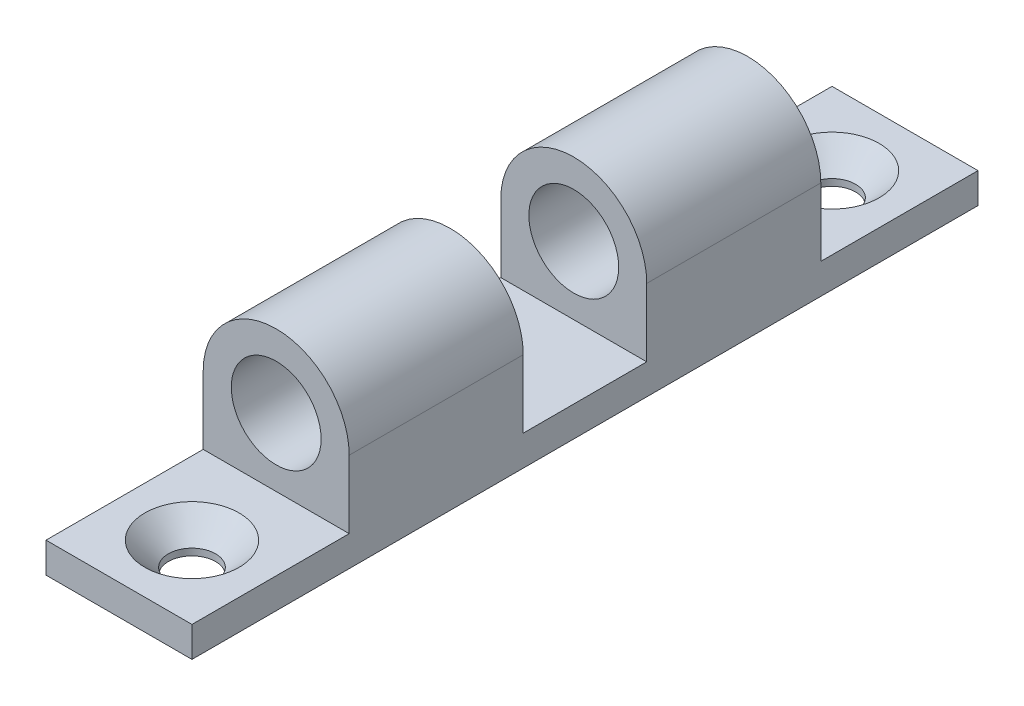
ISO-10303-21;
HEADER;
FILE_DESCRIPTION(('STEP AP214'),'2;1');
FILE_NAME('part.step','',(''),(''),'','','');
FILE_SCHEMA(('AUTOMOTIVE_DESIGN { 1 0 10303 214 1 1 1 1 }'));
ENDSEC;
DATA;
#1=APPLICATION_CONTEXT('core data for automotive mechanical design processes');
#2=APPLICATION_PROTOCOL_DEFINITION('international standard','automotive_design',2000,#1);
#3=PRODUCT_CONTEXT('',#1,'mechanical');
#4=PRODUCT('Part','Part','',(#3));
#5=PRODUCT_RELATED_PRODUCT_CATEGORY('part','',(#4));
#6=PRODUCT_DEFINITION_FORMATION('','',#4);
#7=PRODUCT_DEFINITION_CONTEXT('part definition',#1,'design');
#8=PRODUCT_DEFINITION('design','',#6,#7);
#9=PRODUCT_DEFINITION_SHAPE('','',#8);
#10=(LENGTH_UNIT() NAMED_UNIT(*) SI_UNIT(.MILLI.,.METRE.));
#11=(NAMED_UNIT(*) PLANE_ANGLE_UNIT() SI_UNIT($,.RADIAN.));
#12=(NAMED_UNIT(*) SI_UNIT($,.STERADIAN.) SOLID_ANGLE_UNIT());
#13=UNCERTAINTY_MEASURE_WITH_UNIT(LENGTH_MEASURE(1.E-05),#10,'distance_accuracy_value','');
#14=(GEOMETRIC_REPRESENTATION_CONTEXT(3) GLOBAL_UNCERTAINTY_ASSIGNED_CONTEXT((#13)) GLOBAL_UNIT_ASSIGNED_CONTEXT((#10,
#11,#12)) REPRESENTATION_CONTEXT('',''));
#15=CARTESIAN_POINT('',(0.,0.,0.));
#16=DIRECTION('',(0.,0.,1.));
#17=DIRECTION('',(1.,0.,0.));
#18=AXIS2_PLACEMENT_3D('',#15,#16,#17);
#19=CARTESIAN_POINT('',(0.,8.75,0.));
#20=DIRECTION('',(0.,0.,1.));
#21=DIRECTION('',(1.,0.,0.));
#22=AXIS2_PLACEMENT_3D('',#19,#20,#21);
#23=CYLINDRICAL_SURFACE('',#22,4.);
#24=CARTESIAN_POINT('',(0.,8.75,-5.5));
#25=DIRECTION('',(0.,0.,1.));
#26=DIRECTION('',(1.,0.,0.));
#27=AXIS2_PLACEMENT_3D('',#24,#25,#26);
#28=CIRCLE('',#27,4.);
#29=CARTESIAN_POINT('',(4.,8.75,-5.5));
#30=VERTEX_POINT('',#29);
#31=EDGE_CURVE('E199',#30,#30,#28,.T.);
#32=ORIENTED_EDGE('',*,*,#31,.T.);
#33=EDGE_LOOP('',(#32));
#34=FACE_BOUND('',#33,.T.);
#35=CARTESIAN_POINT('',(0.,8.75,-21.));
#36=DIRECTION('',(0.,0.,1.));
#37=DIRECTION('',(1.,0.,0.));
#38=AXIS2_PLACEMENT_3D('',#35,#36,#37);
#39=CIRCLE('',#38,4.);
#40=CARTESIAN_POINT('',(4.,8.75,-21.));
#41=VERTEX_POINT('',#40);
#42=EDGE_CURVE('E20',#41,#41,#39,.F.);
#43=ORIENTED_EDGE('',*,*,#42,.T.);
#44=EDGE_LOOP('',(#43));
#45=FACE_BOUND('',#44,.T.);
#46=ADVANCED_FACE('F16',(#34,#45),#23,.F.);
#47=CARTESIAN_POINT('',(0.,8.75,0.));
#48=DIRECTION('',(0.,0.,1.));
#49=DIRECTION('',(1.,0.,0.));
#50=AXIS2_PLACEMENT_3D('',#47,#48,#49);
#51=CYLINDRICAL_SURFACE('',#50,4.);
#52=CARTESIAN_POINT('',(0.,8.75,21.));
#53=DIRECTION('',(0.,0.,1.));
#54=DIRECTION('',(1.,0.,0.));
#55=AXIS2_PLACEMENT_3D('',#52,#53,#54);
#56=CIRCLE('',#55,4.);
#57=CARTESIAN_POINT('',(4.,8.75,21.));
#58=VERTEX_POINT('',#57);
#59=EDGE_CURVE('E188',#58,#58,#56,.T.);
#60=ORIENTED_EDGE('',*,*,#59,.T.);
#61=EDGE_LOOP('',(#60));
#62=FACE_BOUND('',#61,.T.);
#63=CARTESIAN_POINT('',(0.,8.75,5.5));
#64=DIRECTION('',(0.,0.,1.));
#65=DIRECTION('',(1.,0.,0.));
#66=AXIS2_PLACEMENT_3D('',#63,#64,#65);
#67=CIRCLE('',#66,4.);
#68=CARTESIAN_POINT('',(4.,8.75,5.5));
#69=VERTEX_POINT('',#68);
#70=EDGE_CURVE('E195',#69,#69,#67,.F.);
#71=ORIENTED_EDGE('',*,*,#70,.T.);
#72=EDGE_LOOP('',(#71));
#73=FACE_BOUND('',#72,.T.);
#74=ADVANCED_FACE('F303',(#62,#73),#51,.F.);
#75=CARTESIAN_POINT('',(6.5,2.7,-21.));
#76=DIRECTION('',(0.,0.,1.));
#77=DIRECTION('',(1.,0.,0.));
#78=AXIS2_PLACEMENT_3D('',#75,#76,#77);
#79=PLANE('',#78);
#80=ORIENTED_EDGE('',*,*,#42,.F.);
#81=EDGE_LOOP('',(#80));
#82=FACE_BOUND('',#81,.T.);
#83=DIRECTION('',(0.,1.,0.));
#84=VECTOR('',#83,1.);
#85=CARTESIAN_POINT('',(6.5,8.75,-21.));
#86=LINE('',#85,#84);
#87=CARTESIAN_POINT('',(6.5,2.7,-21.));
#88=VERTEX_POINT('',#87);
#89=CARTESIAN_POINT('',(6.5,8.75,-21.));
#90=VERTEX_POINT('',#89);
#91=EDGE_CURVE('E107',#88,#90,#86,.T.);
#92=ORIENTED_EDGE('',*,*,#91,.F.);
#93=DIRECTION('',(1.,0.,0.));
#94=VECTOR('',#93,1.);
#95=CARTESIAN_POINT('',(0.,2.7,-21.));
#96=LINE('',#95,#94);
#97=CARTESIAN_POINT('',(-6.5,2.7,-21.));
#98=VERTEX_POINT('',#97);
#99=EDGE_CURVE('E134',#98,#88,#96,.T.);
#100=ORIENTED_EDGE('',*,*,#99,.F.);
#101=DIRECTION('',(0.,1.,0.));
#102=VECTOR('',#101,1.);
#103=CARTESIAN_POINT('',(-6.5,0.,-21.));
#104=LINE('',#103,#102);
#105=CARTESIAN_POINT('',(-6.5,8.75,-21.));
#106=VERTEX_POINT('',#105);
#107=EDGE_CURVE('E110',#106,#98,#104,.F.);
#108=ORIENTED_EDGE('',*,*,#107,.F.);
#109=CARTESIAN_POINT('',(0.,8.75,-21.));
#110=DIRECTION('',(0.,0.,1.));
#111=DIRECTION('',(1.,0.,0.));
#112=AXIS2_PLACEMENT_3D('',#109,#110,#111);
#113=CIRCLE('',#112,6.5);
#114=EDGE_CURVE('E103',#90,#106,#113,.T.);
#115=ORIENTED_EDGE('',*,*,#114,.F.);
#116=EDGE_LOOP('',(#92,#100,#108,#115));
#117=FACE_BOUND('',#116,.T.);
#118=ADVANCED_FACE('F105',(#82,#117),#79,.F.);
#119=CARTESIAN_POINT('',(0.,8.75,0.));
#120=DIRECTION('',(0.,0.,1.));
#121=DIRECTION('',(1.,0.,0.));
#122=AXIS2_PLACEMENT_3D('',#119,#120,#121);
#123=CYLINDRICAL_SURFACE('',#122,6.5);
#124=CARTESIAN_POINT('',(0.,8.75,-5.5));
#125=DIRECTION('',(0.,0.,1.));
#126=DIRECTION('',(1.,0.,0.));
#127=AXIS2_PLACEMENT_3D('',#124,#125,#126);
#128=CIRCLE('',#127,6.5);
#129=CARTESIAN_POINT('',(-6.5,8.75,-5.5));
#130=VERTEX_POINT('',#129);
#131=CARTESIAN_POINT('',(6.5,8.75,-5.5));
#132=VERTEX_POINT('',#131);
#133=EDGE_CURVE('E114',#130,#132,#128,.F.);
#134=ORIENTED_EDGE('',*,*,#133,.T.);
#135=DIRECTION('',(0.,0.,-1.));
#136=VECTOR('',#135,1.);
#137=CARTESIAN_POINT('',(6.5,8.75,0.));
#138=LINE('',#137,#136);
#139=EDGE_CURVE('E116',#90,#132,#138,.F.);
#140=ORIENTED_EDGE('',*,*,#139,.F.);
#141=ORIENTED_EDGE('',*,*,#114,.T.);
#142=DIRECTION('',(0.,0.,1.));
#143=VECTOR('',#142,1.);
#144=CARTESIAN_POINT('',(-6.5,8.75,0.));
#145=LINE('',#144,#143);
#146=EDGE_CURVE('E140',#130,#106,#145,.F.);
#147=ORIENTED_EDGE('',*,*,#146,.F.);
#148=EDGE_LOOP('',(#134,#140,#141,#147));
#149=FACE_BOUND('',#148,.T.);
#150=ADVANCED_FACE('F117',(#149),#123,.T.);
#151=CARTESIAN_POINT('',(-6.5,2.7,-5.5));
#152=DIRECTION('',(0.,0.,-1.));
#153=DIRECTION('',(-1.,0.,0.));
#154=AXIS2_PLACEMENT_3D('',#151,#152,#153);
#155=PLANE('',#154);
#156=ORIENTED_EDGE('',*,*,#31,.F.);
#157=EDGE_LOOP('',(#156));
#158=FACE_BOUND('',#157,.T.);
#159=DIRECTION('',(0.,1.,0.));
#160=VECTOR('',#159,1.);
#161=CARTESIAN_POINT('',(-6.5,0.,-5.5));
#162=LINE('',#161,#160);
#163=CARTESIAN_POINT('',(-6.5,2.7,-5.5));
#164=VERTEX_POINT('',#163);
#165=EDGE_CURVE('E142',#164,#130,#162,.T.);
#166=ORIENTED_EDGE('',*,*,#165,.F.);
#167=DIRECTION('',(1.,0.,0.));
#168=VECTOR('',#167,1.);
#169=CARTESIAN_POINT('',(0.,2.7,-5.5));
#170=LINE('',#169,#168);
#171=CARTESIAN_POINT('',(6.5,2.7,-5.5));
#172=VERTEX_POINT('',#171);
#173=EDGE_CURVE('E202',#172,#164,#170,.F.);
#174=ORIENTED_EDGE('',*,*,#173,.F.);
#175=DIRECTION('',(0.,1.,0.));
#176=VECTOR('',#175,1.);
#177=CARTESIAN_POINT('',(6.5,8.75,-5.5));
#178=LINE('',#177,#176);
#179=EDGE_CURVE('E121',#132,#172,#178,.F.);
#180=ORIENTED_EDGE('',*,*,#179,.F.);
#181=ORIENTED_EDGE('',*,*,#133,.F.);
#182=EDGE_LOOP('',(#166,#174,#180,#181));
#183=FACE_BOUND('',#182,.T.);
#184=ADVANCED_FACE('F312',(#158,#183),#155,.F.);
#185=CARTESIAN_POINT('',(0.,2.7,0.));
#186=DIRECTION('',(0.,1.,0.));
#187=DIRECTION('',(0.,0.,1.));
#188=AXIS2_PLACEMENT_3D('',#185,#186,#187);
#189=PLANE('',#188);
#190=DIRECTION('',(0.,0.,-1.));
#191=VECTOR('',#190,1.);
#192=CARTESIAN_POINT('',(6.5,2.7,0.));
#193=LINE('',#192,#191);
#194=CARTESIAN_POINT('',(6.5,2.7,5.5));
#195=VERTEX_POINT('',#194);
#196=EDGE_CURVE('E212',#172,#195,#193,.F.);
#197=ORIENTED_EDGE('',*,*,#196,.F.);
#198=ORIENTED_EDGE('',*,*,#173,.T.);
#199=DIRECTION('',(0.,0.,1.));
#200=VECTOR('',#199,1.);
#201=CARTESIAN_POINT('',(-6.5,2.7,0.));
#202=LINE('',#201,#200);
#203=CARTESIAN_POINT('',(-6.5,2.7,5.5));
#204=VERTEX_POINT('',#203);
#205=EDGE_CURVE('E145',#204,#164,#202,.F.);
#206=ORIENTED_EDGE('',*,*,#205,.F.);
#207=DIRECTION('',(1.,0.,0.));
#208=VECTOR('',#207,1.);
#209=CARTESIAN_POINT('',(6.5,2.7,5.5));
#210=LINE('',#209,#208);
#211=EDGE_CURVE('E198',#204,#195,#210,.T.);
#212=ORIENTED_EDGE('',*,*,#211,.T.);
#213=EDGE_LOOP('',(#197,#198,#206,#212));
#214=FACE_BOUND('',#213,.T.);
#215=ADVANCED_FACE('F315',(#214),#189,.T.);
#216=CARTESIAN_POINT('',(6.5,2.7,5.5));
#217=DIRECTION('',(0.,0.,1.));
#218=DIRECTION('',(1.,0.,0.));
#219=AXIS2_PLACEMENT_3D('',#216,#217,#218);
#220=PLANE('',#219);
#221=ORIENTED_EDGE('',*,*,#70,.F.);
#222=EDGE_LOOP('',(#221));
#223=FACE_BOUND('',#222,.T.);
#224=DIRECTION('',(0.,1.,0.));
#225=VECTOR('',#224,1.);
#226=CARTESIAN_POINT('',(6.5,8.75,5.5));
#227=LINE('',#226,#225);
#228=CARTESIAN_POINT('',(6.5,8.75,5.5));
#229=VERTEX_POINT('',#228);
#230=EDGE_CURVE('E214',#195,#229,#227,.T.);
#231=ORIENTED_EDGE('',*,*,#230,.F.);
#232=ORIENTED_EDGE('',*,*,#211,.F.);
#233=DIRECTION('',(0.,1.,0.));
#234=VECTOR('',#233,1.);
#235=CARTESIAN_POINT('',(-6.5,0.,5.5));
#236=LINE('',#235,#234);
#237=CARTESIAN_POINT('',(-6.5,8.75,5.5));
#238=VERTEX_POINT('',#237);
#239=EDGE_CURVE('E148',#238,#204,#236,.F.);
#240=ORIENTED_EDGE('',*,*,#239,.F.);
#241=CARTESIAN_POINT('',(0.,8.75,5.5));
#242=DIRECTION('',(0.,0.,1.));
#243=DIRECTION('',(1.,0.,0.));
#244=AXIS2_PLACEMENT_3D('',#241,#242,#243);
#245=CIRCLE('',#244,6.5);
#246=EDGE_CURVE('E193',#229,#238,#245,.T.);
#247=ORIENTED_EDGE('',*,*,#246,.F.);
#248=EDGE_LOOP('',(#231,#232,#240,#247));
#249=FACE_BOUND('',#248,.T.);
#250=ADVANCED_FACE('F319',(#223,#249),#220,.F.);
#251=CARTESIAN_POINT('',(0.,8.75,0.));
#252=DIRECTION('',(0.,0.,1.));
#253=DIRECTION('',(1.,0.,0.));
#254=AXIS2_PLACEMENT_3D('',#251,#252,#253);
#255=CYLINDRICAL_SURFACE('',#254,6.5);
#256=ORIENTED_EDGE('',*,*,#246,.T.);
#257=DIRECTION('',(0.,0.,1.));
#258=VECTOR('',#257,1.);
#259=CARTESIAN_POINT('',(-6.5,8.75,0.));
#260=LINE('',#259,#258);
#261=CARTESIAN_POINT('',(-6.5,8.75,21.));
#262=VERTEX_POINT('',#261);
#263=EDGE_CURVE('E151',#262,#238,#260,.F.);
#264=ORIENTED_EDGE('',*,*,#263,.F.);
#265=CARTESIAN_POINT('',(0.,8.75,21.));
#266=DIRECTION('',(0.,0.,1.));
#267=DIRECTION('',(1.,0.,0.));
#268=AXIS2_PLACEMENT_3D('',#265,#266,#267);
#269=CIRCLE('',#268,6.5);
#270=CARTESIAN_POINT('',(6.5,8.75,21.));
#271=VERTEX_POINT('',#270);
#272=EDGE_CURVE('E191',#262,#271,#269,.F.);
#273=ORIENTED_EDGE('',*,*,#272,.T.);
#274=DIRECTION('',(0.,0.,-1.));
#275=VECTOR('',#274,1.);
#276=CARTESIAN_POINT('',(6.5,8.75,0.));
#277=LINE('',#276,#275);
#278=EDGE_CURVE('E216',#229,#271,#277,.F.);
#279=ORIENTED_EDGE('',*,*,#278,.F.);
#280=EDGE_LOOP('',(#256,#264,#273,#279));
#281=FACE_BOUND('',#280,.T.);
#282=ADVANCED_FACE('F322',(#281),#255,.T.);
#283=CARTESIAN_POINT('',(-6.5,2.7,21.));
#284=DIRECTION('',(0.,0.,-1.));
#285=DIRECTION('',(-1.,0.,0.));
#286=AXIS2_PLACEMENT_3D('',#283,#284,#285);
#287=PLANE('',#286);
#288=ORIENTED_EDGE('',*,*,#59,.F.);
#289=EDGE_LOOP('',(#288));
#290=FACE_BOUND('',#289,.T.);
#291=DIRECTION('',(0.,1.,0.));
#292=VECTOR('',#291,1.);
#293=CARTESIAN_POINT('',(-6.5,0.,21.));
#294=LINE('',#293,#292);
#295=CARTESIAN_POINT('',(-6.5,2.7,21.));
#296=VERTEX_POINT('',#295);
#297=EDGE_CURVE('E154',#296,#262,#294,.T.);
#298=ORIENTED_EDGE('',*,*,#297,.F.);
#299=DIRECTION('',(1.,0.,0.));
#300=VECTOR('',#299,1.);
#301=CARTESIAN_POINT('',(0.,2.7,21.));
#302=LINE('',#301,#300);
#303=CARTESIAN_POINT('',(6.5,2.7,21.));
#304=VERTEX_POINT('',#303);
#305=EDGE_CURVE('E137',#304,#296,#302,.F.);
#306=ORIENTED_EDGE('',*,*,#305,.F.);
#307=DIRECTION('',(0.,1.,0.));
#308=VECTOR('',#307,1.);
#309=CARTESIAN_POINT('',(6.5,8.75,21.));
#310=LINE('',#309,#308);
#311=EDGE_CURVE('E220',#271,#304,#310,.F.);
#312=ORIENTED_EDGE('',*,*,#311,.F.);
#313=ORIENTED_EDGE('',*,*,#272,.F.);
#314=EDGE_LOOP('',(#298,#306,#312,#313));
#315=FACE_BOUND('',#314,.T.);
#316=ADVANCED_FACE('F326',(#290,#315),#287,.F.);
#317=CARTESIAN_POINT('',(0.,2.7,28.));
#318=DIRECTION('',(0.,1.,0.));
#319=DIRECTION('',(0.,0.,1.));
#320=AXIS2_PLACEMENT_3D('',#317,#318,#319);
#321=PLANE('',#320);
#322=CARTESIAN_POINT('',(0.,2.7,28.5));
#323=DIRECTION('',(0.,1.,0.));
#324=DIRECTION('',(-1.,0.,0.));
#325=AXIS2_PLACEMENT_3D('',#322,#323,#324);
#326=CIRCLE('',#325,4.2);
#327=CARTESIAN_POINT('',(-4.2,2.7,28.5));
#328=VERTEX_POINT('',#327);
#329=EDGE_CURVE('E166',#328,#328,#326,.F.);
#330=ORIENTED_EDGE('',*,*,#329,.T.);
#331=EDGE_LOOP('',(#330));
#332=FACE_BOUND('',#331,.T.);
#333=ORIENTED_EDGE('',*,*,#305,.T.);
#334=DIRECTION('',(0.,0.,1.));
#335=VECTOR('',#334,1.);
#336=CARTESIAN_POINT('',(-6.5,2.7,0.));
#337=LINE('',#336,#335);
#338=CARTESIAN_POINT('',(-6.5,2.7,35.));
#339=VERTEX_POINT('',#338);
#340=EDGE_CURVE('E157',#339,#296,#337,.F.);
#341=ORIENTED_EDGE('',*,*,#340,.F.);
#342=DIRECTION('',(1.,0.,0.));
#343=VECTOR('',#342,1.);
#344=CARTESIAN_POINT('',(0.,2.7,35.));
#345=LINE('',#344,#343);
#346=CARTESIAN_POINT('',(6.5,2.7,35.));
#347=VERTEX_POINT('',#346);
#348=EDGE_CURVE('E164',#347,#339,#345,.F.);
#349=ORIENTED_EDGE('',*,*,#348,.F.);
#350=DIRECTION('',(0.,0.,-1.));
#351=VECTOR('',#350,1.);
#352=CARTESIAN_POINT('',(6.5,2.7,0.));
#353=LINE('',#352,#351);
#354=EDGE_CURVE('E179',#304,#347,#353,.F.);
#355=ORIENTED_EDGE('',*,*,#354,.F.);
#356=EDGE_LOOP('',(#333,#341,#349,#355));
#357=FACE_BOUND('',#356,.T.);
#358=ADVANCED_FACE('F296',(#332,#357),#321,.T.);
#359=CARTESIAN_POINT('',(0.,2.7,-28.));
#360=DIRECTION('',(0.,1.,0.));
#361=DIRECTION('',(0.,0.,1.));
#362=AXIS2_PLACEMENT_3D('',#359,#360,#361);
#363=PLANE('',#362);
#364=CARTESIAN_POINT('',(0.,2.7,-28.5));
#365=DIRECTION('',(0.,1.,0.));
#366=DIRECTION('',(0.,0.,1.));
#367=AXIS2_PLACEMENT_3D('',#364,#365,#366);
#368=CIRCLE('',#367,4.2);
#369=CARTESIAN_POINT('',(0.,2.7,-24.3));
#370=VERTEX_POINT('',#369);
#371=EDGE_CURVE('E136',#370,#370,#368,.F.);
#372=ORIENTED_EDGE('',*,*,#371,.T.);
#373=EDGE_LOOP('',(#372));
#374=FACE_BOUND('',#373,.T.);
#375=ORIENTED_EDGE('',*,*,#99,.T.);
#376=DIRECTION('',(0.,0.,-1.));
#377=VECTOR('',#376,1.);
#378=CARTESIAN_POINT('',(6.5,2.7,0.));
#379=LINE('',#378,#377);
#380=CARTESIAN_POINT('',(6.5,2.7,-35.));
#381=VERTEX_POINT('',#380);
#382=EDGE_CURVE('E126',#381,#88,#379,.F.);
#383=ORIENTED_EDGE('',*,*,#382,.F.);
#384=DIRECTION('',(1.,0.,0.));
#385=VECTOR('',#384,1.);
#386=CARTESIAN_POINT('',(0.,2.7,-35.));
#387=LINE('',#386,#385);
#388=CARTESIAN_POINT('',(-6.5,2.7,-35.));
#389=VERTEX_POINT('',#388);
#390=EDGE_CURVE('E127',#381,#389,#387,.F.);
#391=ORIENTED_EDGE('',*,*,#390,.T.);
#392=DIRECTION('',(0.,0.,1.));
#393=VECTOR('',#392,1.);
#394=CARTESIAN_POINT('',(-6.5,2.7,0.));
#395=LINE('',#394,#393);
#396=EDGE_CURVE('E163',#98,#389,#395,.F.);
#397=ORIENTED_EDGE('',*,*,#396,.F.);
#398=EDGE_LOOP('',(#375,#383,#391,#397));
#399=FACE_BOUND('',#398,.T.);
#400=ADVANCED_FACE('F288',(#374,#399),#363,.T.);
#401=CARTESIAN_POINT('',(0.,2.7,-28.5));
#402=DIRECTION('',(0.,1.,0.));
#403=DIRECTION('',(0.,0.,1.));
#404=AXIS2_PLACEMENT_3D('',#401,#402,#403);
#405=CONICAL_SURFACE('',#404,4.2,0.785398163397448);
#406=ORIENTED_EDGE('',*,*,#371,.F.);
#407=EDGE_LOOP('',(#406));
#408=FACE_BOUND('',#407,.T.);
#409=CARTESIAN_POINT('',(0.,0.600000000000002,-28.5));
#410=DIRECTION('',(0.,-1.,0.));
#411=DIRECTION('',(1.,0.,0.));
#412=AXIS2_PLACEMENT_3D('',#409,#410,#411);
#413=CIRCLE('',#412,2.1);
#414=CARTESIAN_POINT('',(2.1,0.600000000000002,-28.5));
#415=VERTEX_POINT('',#414);
#416=EDGE_CURVE('E139',#415,#415,#413,.T.);
#417=ORIENTED_EDGE('',*,*,#416,.T.);
#418=EDGE_LOOP('',(#417));
#419=FACE_BOUND('',#418,.T.);
#420=ADVANCED_FACE('F286',(#408,#419),#405,.F.);
#421=CARTESIAN_POINT('',(0.,2.7,28.5));
#422=DIRECTION('',(0.,1.,0.));
#423=DIRECTION('',(-1.,0.,0.));
#424=AXIS2_PLACEMENT_3D('',#421,#422,#423);
#425=CONICAL_SURFACE('',#424,4.2,0.785398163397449);
#426=ORIENTED_EDGE('',*,*,#329,.F.);
#427=EDGE_LOOP('',(#426));
#428=FACE_BOUND('',#427,.T.);
#429=CARTESIAN_POINT('',(0.,0.600000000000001,28.5));
#430=DIRECTION('',(0.,-1.,0.));
#431=DIRECTION('',(1.,0.,0.));
#432=AXIS2_PLACEMENT_3D('',#429,#430,#431);
#433=CIRCLE('',#432,2.1);
#434=CARTESIAN_POINT('',(2.1,0.600000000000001,28.5));
#435=VERTEX_POINT('',#434);
#436=EDGE_CURVE('E174',#435,#435,#433,.T.);
#437=ORIENTED_EDGE('',*,*,#436,.T.);
#438=EDGE_LOOP('',(#437));
#439=FACE_BOUND('',#438,.T.);
#440=ADVANCED_FACE('F18',(#428,#439),#425,.F.);
#441=CARTESIAN_POINT('',(0.,6.50871220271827,35.));
#442=DIRECTION('',(0.,0.,1.));
#443=DIRECTION('',(1.,0.,0.));
#444=AXIS2_PLACEMENT_3D('',#441,#442,#443);
#445=PLANE('',#444);
#446=DIRECTION('',(1.,0.,0.));
#447=VECTOR('',#446,1.);
#448=CARTESIAN_POINT('',(6.5,0.,35.));
#449=LINE('',#448,#447);
#450=CARTESIAN_POINT('',(6.5,0.,35.));
#451=VERTEX_POINT('',#450);
#452=CARTESIAN_POINT('',(-6.5,0.,35.));
#453=VERTEX_POINT('',#452);
#454=EDGE_CURVE('E171',#451,#453,#449,.F.);
#455=ORIENTED_EDGE('',*,*,#454,.F.);
#456=DIRECTION('',(0.,1.,0.));
#457=VECTOR('',#456,1.);
#458=CARTESIAN_POINT('',(6.5,8.75,35.));
#459=LINE('',#458,#457);
#460=EDGE_CURVE('E177',#347,#451,#459,.F.);
#461=ORIENTED_EDGE('',*,*,#460,.F.);
#462=ORIENTED_EDGE('',*,*,#348,.T.);
#463=DIRECTION('',(0.,1.,0.));
#464=VECTOR('',#463,1.);
#465=CARTESIAN_POINT('',(-6.5,0.,35.));
#466=LINE('',#465,#464);
#467=EDGE_CURVE('E160',#453,#339,#466,.T.);
#468=ORIENTED_EDGE('',*,*,#467,.F.);
#469=EDGE_LOOP('',(#455,#461,#462,#468));
#470=FACE_BOUND('',#469,.T.);
#471=ADVANCED_FACE('F246',(#470),#445,.T.);
#472=CARTESIAN_POINT('',(-6.5,0.,0.));
#473=DIRECTION('',(-1.,0.,0.));
#474=DIRECTION('',(0.,0.,1.));
#475=AXIS2_PLACEMENT_3D('',#472,#473,#474);
#476=PLANE('',#475);
#477=ORIENTED_EDGE('',*,*,#165,.T.);
#478=ORIENTED_EDGE('',*,*,#146,.T.);
#479=ORIENTED_EDGE('',*,*,#107,.T.);
#480=ORIENTED_EDGE('',*,*,#396,.T.);
#481=DIRECTION('',(0.,1.,0.));
#482=VECTOR('',#481,1.);
#483=CARTESIAN_POINT('',(-6.5,6.50871220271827,-35.));
#484=LINE('',#483,#482);
#485=CARTESIAN_POINT('',(-6.5,0.,-35.));
#486=VERTEX_POINT('',#485);
#487=EDGE_CURVE('E130',#389,#486,#484,.F.);
#488=ORIENTED_EDGE('',*,*,#487,.T.);
#489=DIRECTION('',(0.,0.,-1.));
#490=VECTOR('',#489,1.);
#491=CARTESIAN_POINT('',(-6.5,0.,0.));
#492=LINE('',#491,#490);
#493=EDGE_CURVE('E167',#453,#486,#492,.T.);
#494=ORIENTED_EDGE('',*,*,#493,.F.);
#495=ORIENTED_EDGE('',*,*,#467,.T.);
#496=ORIENTED_EDGE('',*,*,#340,.T.);
#497=ORIENTED_EDGE('',*,*,#297,.T.);
#498=ORIENTED_EDGE('',*,*,#263,.T.);
#499=ORIENTED_EDGE('',*,*,#239,.T.);
#500=ORIENTED_EDGE('',*,*,#205,.T.);
#501=EDGE_LOOP('',(#477,#478,#479,#480,#488,#494,#495,#496,#497,#498,#499,#500));
#502=FACE_BOUND('',#501,.T.);
#503=ADVANCED_FACE('F250',(#502),#476,.T.);
#504=CARTESIAN_POINT('',(0.,6.50871220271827,-35.));
#505=DIRECTION('',(0.,0.,1.));
#506=DIRECTION('',(1.,0.,0.));
#507=AXIS2_PLACEMENT_3D('',#504,#505,#506);
#508=PLANE('',#507);
#509=DIRECTION('',(0.,1.,0.));
#510=VECTOR('',#509,1.);
#511=CARTESIAN_POINT('',(6.5,8.75,-35.));
#512=LINE('',#511,#510);
#513=CARTESIAN_POINT('',(6.5,0.,-35.));
#514=VERTEX_POINT('',#513);
#515=EDGE_CURVE('E35',#514,#381,#512,.T.);
#516=ORIENTED_EDGE('',*,*,#515,.F.);
#517=DIRECTION('',(1.,0.,0.));
#518=VECTOR('',#517,1.);
#519=CARTESIAN_POINT('',(6.5,0.,-35.));
#520=LINE('',#519,#518);
#521=EDGE_CURVE('E170',#486,#514,#520,.T.);
#522=ORIENTED_EDGE('',*,*,#521,.F.);
#523=ORIENTED_EDGE('',*,*,#487,.F.);
#524=ORIENTED_EDGE('',*,*,#390,.F.);
#525=EDGE_LOOP('',(#516,#522,#523,#524));
#526=FACE_BOUND('',#525,.T.);
#527=ADVANCED_FACE('F253',(#526),#508,.F.);
#528=CARTESIAN_POINT('',(6.5,8.75,0.));
#529=DIRECTION('',(1.,0.,0.));
#530=DIRECTION('',(0.,0.,-1.));
#531=AXIS2_PLACEMENT_3D('',#528,#529,#530);
#532=PLANE('',#531);
#533=ORIENTED_EDGE('',*,*,#515,.T.);
#534=ORIENTED_EDGE('',*,*,#382,.T.);
#535=ORIENTED_EDGE('',*,*,#91,.T.);
#536=ORIENTED_EDGE('',*,*,#139,.T.);
#537=ORIENTED_EDGE('',*,*,#179,.T.);
#538=ORIENTED_EDGE('',*,*,#196,.T.);
#539=ORIENTED_EDGE('',*,*,#230,.T.);
#540=ORIENTED_EDGE('',*,*,#278,.T.);
#541=ORIENTED_EDGE('',*,*,#311,.T.);
#542=ORIENTED_EDGE('',*,*,#354,.T.);
#543=ORIENTED_EDGE('',*,*,#460,.T.);
#544=DIRECTION('',(0.,0.,-1.));
#545=VECTOR('',#544,1.);
#546=CARTESIAN_POINT('',(6.5,0.,0.));
#547=LINE('',#546,#545);
#548=EDGE_CURVE('E183',#514,#451,#547,.F.);
#549=ORIENTED_EDGE('',*,*,#548,.F.);
#550=EDGE_LOOP('',(#533,#534,#535,#536,#537,#538,#539,#540,#541,#542,#543,#549));
#551=FACE_BOUND('',#550,.T.);
#552=ADVANCED_FACE('F124',(#551),#532,.T.);
#553=CARTESIAN_POINT('',(0.,2.7,-28.5));
#554=DIRECTION('',(0.,-1.,0.));
#555=DIRECTION('',(1.,0.,0.));
#556=AXIS2_PLACEMENT_3D('',#553,#554,#555);
#557=CYLINDRICAL_SURFACE('',#556,2.1);
#558=CARTESIAN_POINT('',(0.,0.,-28.5));
#559=DIRECTION('',(0.,-1.,0.));
#560=DIRECTION('',(1.,0.,0.));
#561=AXIS2_PLACEMENT_3D('',#558,#559,#560);
#562=CIRCLE('',#561,2.1);
#563=CARTESIAN_POINT('',(2.1,0.,-28.5));
#564=VERTEX_POINT('',#563);
#565=EDGE_CURVE('E26',#564,#564,#562,.F.);
#566=ORIENTED_EDGE('',*,*,#565,.F.);
#567=EDGE_LOOP('',(#566));
#568=FACE_BOUND('',#567,.T.);
#569=ORIENTED_EDGE('',*,*,#416,.F.);
#570=EDGE_LOOP('',(#569));
#571=FACE_BOUND('',#570,.T.);
#572=ADVANCED_FACE('F262',(#568,#571),#557,.F.);
#573=CARTESIAN_POINT('',(0.,2.7,28.5));
#574=DIRECTION('',(0.,-1.,0.));
#575=DIRECTION('',(1.,0.,0.));
#576=AXIS2_PLACEMENT_3D('',#573,#574,#575);
#577=CYLINDRICAL_SURFACE('',#576,2.1);
#578=CARTESIAN_POINT('',(0.,0.,28.5));
#579=DIRECTION('',(0.,-1.,0.));
#580=DIRECTION('',(1.,0.,0.));
#581=AXIS2_PLACEMENT_3D('',#578,#579,#580);
#582=CIRCLE('',#581,2.1);
#583=CARTESIAN_POINT('',(2.1,0.,28.5));
#584=VERTEX_POINT('',#583);
#585=EDGE_CURVE('E11',#584,#584,#582,.F.);
#586=ORIENTED_EDGE('',*,*,#585,.F.);
#587=EDGE_LOOP('',(#586));
#588=FACE_BOUND('',#587,.T.);
#589=ORIENTED_EDGE('',*,*,#436,.F.);
#590=EDGE_LOOP('',(#589));
#591=FACE_BOUND('',#590,.T.);
#592=ADVANCED_FACE('F266',(#588,#591),#577,.F.);
#593=CARTESIAN_POINT('',(6.5,0.,0.));
#594=DIRECTION('',(0.,-1.,0.));
#595=DIRECTION('',(0.,0.,-1.));
#596=AXIS2_PLACEMENT_3D('',#593,#594,#595);
#597=PLANE('',#596);
#598=ORIENTED_EDGE('',*,*,#585,.T.);
#599=EDGE_LOOP('',(#598));
#600=FACE_BOUND('',#599,.T.);
#601=ORIENTED_EDGE('',*,*,#565,.T.);
#602=EDGE_LOOP('',(#601));
#603=FACE_BOUND('',#602,.T.);
#604=ORIENTED_EDGE('',*,*,#521,.T.);
#605=ORIENTED_EDGE('',*,*,#548,.T.);
#606=ORIENTED_EDGE('',*,*,#454,.T.);
#607=ORIENTED_EDGE('',*,*,#493,.T.);
#608=EDGE_LOOP('',(#604,#605,#606,#607));
#609=FACE_BOUND('',#608,.T.);
#610=ADVANCED_FACE('F242',(#600,#603,#609),#597,.T.);
#611=CLOSED_SHELL('',(#46,#74,#118,#150,#184,#215,#250,#282,#316,#358,#400,#420,#440,#471,#503,
#527,#552,#572,#592,#610));
#612=MANIFOLD_SOLID_BREP('B1',#611);
#613=ADVANCED_BREP_SHAPE_REPRESENTATION('',(#18,#612),#14);
#614=SHAPE_DEFINITION_REPRESENTATION(#9,#613);
ENDSEC;
END-ISO-10303-21;
